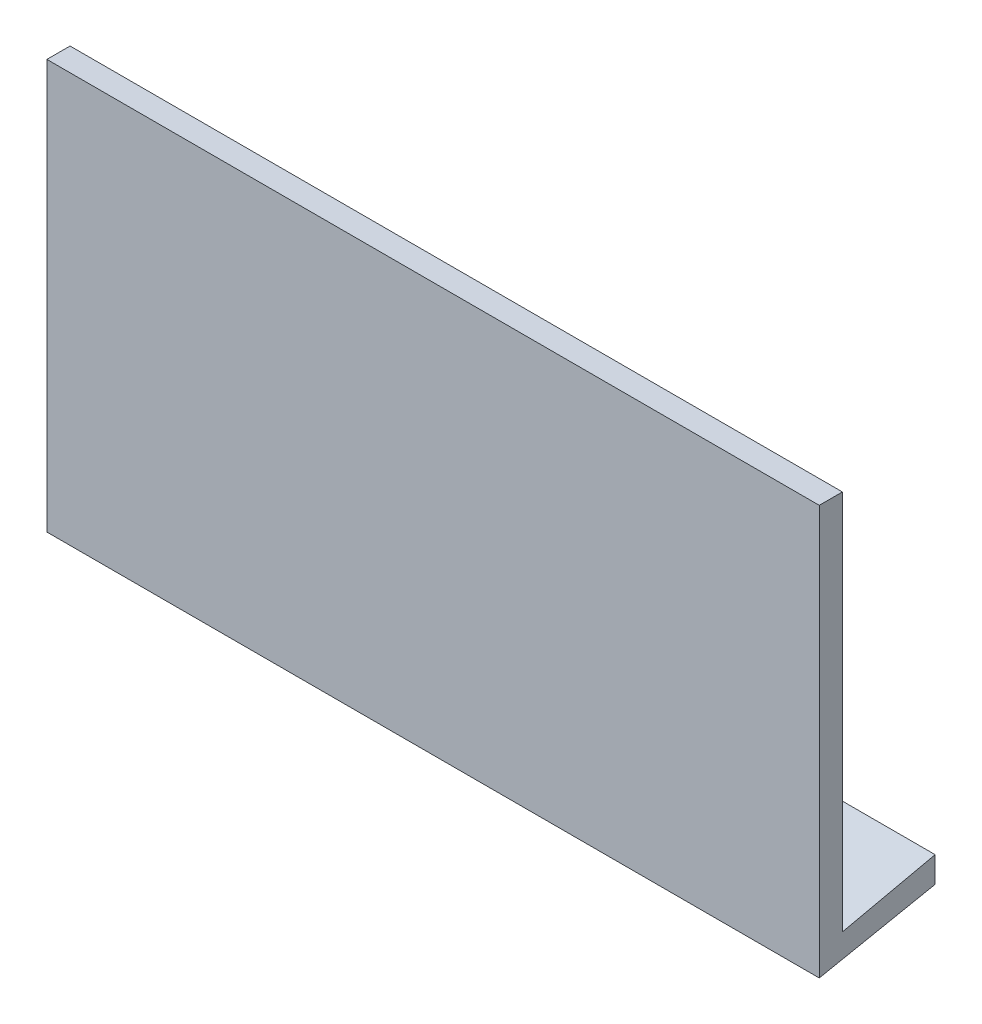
from build123d import *

# Parameters (mm, degrees)
ESBO_O2_W                = 600
ESBO_O2_H                = 300
RESSALTO_EXTRUS_O1_DEPTH = 18
RESSALTO_EXTRUS_O3_DEPTH = 600


with BuildPart() as part:
    # Esbo_o2 → Ressalto-extrus_o1 (new body)
    with BuildSketch(Plane.XY):
        with Locations((0.049719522, -150)):
            Rectangle(ESBO_O2_W, ESBO_O2_H)
    extrude(amount=RESSALTO_EXTRUS_O1_DEPTH)

    # Esbo_o4 → Ressalto-extrus_o3 (add)
    with BuildSketch(Plane(origin=(300.049719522, 0, 0), x_dir=(0, 0, -1), z_dir=(1, 0, 0))):
        Polygon((-18, -318), (72, -300), (72, -280), (-18, -300), align=None)
    extrude(amount=-RESSALTO_EXTRUS_O3_DEPTH)


solid = part.part
